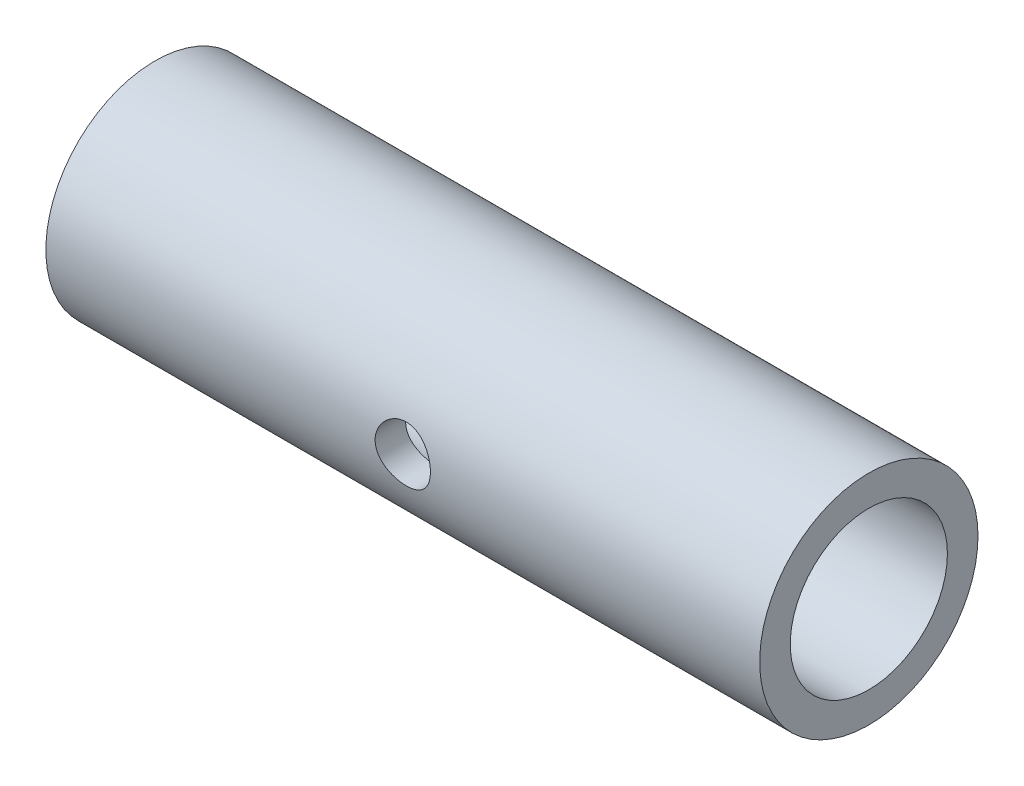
from build123d import *

# Parameters (mm, degrees)
SKETCH1_R               = 9.525
SKETCH1_R_2             = 6.858
EXTRUDE1_DEPTH          = 31.1404
CUT_EXTRUDE1_DEPTH      = 34.928981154
CUT_EXTRUDE1_DEPTH_BACK = 34.928981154
SKETCH2_R               = 2.413


with BuildPart() as part:
    # Sketch1 → Extrude1 (new, symmetric)
    with BuildSketch(Plane(origin=(0, 0, 0), x_dir=(0, 0, -1), z_dir=(1, 0, 0))):
        Circle(SKETCH1_R)
        Circle(SKETCH1_R_2, mode=Mode.SUBTRACT)
    extrude(amount=EXTRUDE1_DEPTH, both=True)

    # Sketch2 → Cut-Extrude1 (cut, two sides: drawn at the far end of the back side and taken through both)
    with BuildSketch(Plane.XY.offset(-CUT_EXTRUDE1_DEPTH_BACK)):
        Circle(SKETCH2_R)
    extrude(amount=CUT_EXTRUDE1_DEPTH + CUT_EXTRUDE1_DEPTH_BACK, mode=Mode.SUBTRACT)


solid = part.part
